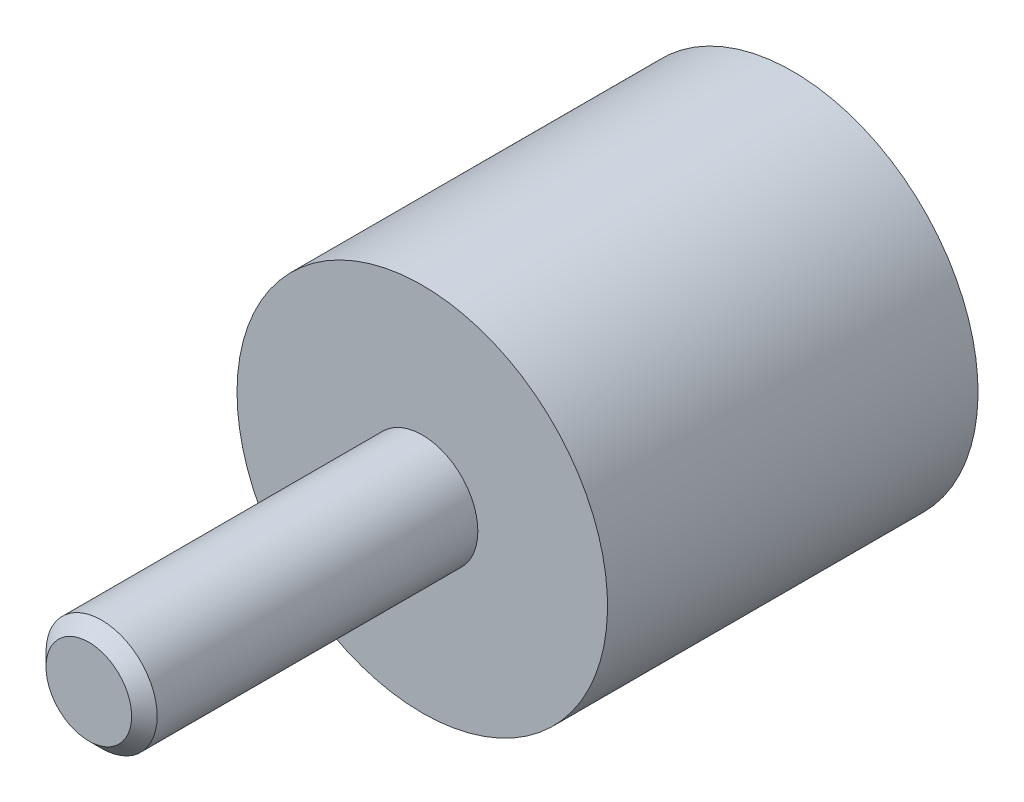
ISO-10303-21;
HEADER;
FILE_DESCRIPTION(('STEP AP214'),'2;1');
FILE_NAME('part.step','',(''),(''),'','','');
FILE_SCHEMA(('AUTOMOTIVE_DESIGN { 1 0 10303 214 1 1 1 1 }'));
ENDSEC;
DATA;
#1=APPLICATION_CONTEXT('core data for automotive mechanical design processes');
#2=APPLICATION_PROTOCOL_DEFINITION('international standard','automotive_design',2000,#1);
#3=PRODUCT_CONTEXT('',#1,'mechanical');
#4=PRODUCT('Part','Part','',(#3));
#5=PRODUCT_RELATED_PRODUCT_CATEGORY('part','',(#4));
#6=PRODUCT_DEFINITION_FORMATION('','',#4);
#7=PRODUCT_DEFINITION_CONTEXT('part definition',#1,'design');
#8=PRODUCT_DEFINITION('design','',#6,#7);
#9=PRODUCT_DEFINITION_SHAPE('','',#8);
#10=(LENGTH_UNIT() NAMED_UNIT(*) SI_UNIT(.MILLI.,.METRE.));
#11=(NAMED_UNIT(*) PLANE_ANGLE_UNIT() SI_UNIT($,.RADIAN.));
#12=(NAMED_UNIT(*) SI_UNIT($,.STERADIAN.) SOLID_ANGLE_UNIT());
#13=UNCERTAINTY_MEASURE_WITH_UNIT(LENGTH_MEASURE(1.E-05),#10,'distance_accuracy_value','');
#14=(GEOMETRIC_REPRESENTATION_CONTEXT(3) GLOBAL_UNCERTAINTY_ASSIGNED_CONTEXT((#13)) GLOBAL_UNIT_ASSIGNED_CONTEXT((#10,
#11,#12)) REPRESENTATION_CONTEXT('',''));
#15=CARTESIAN_POINT('',(0.,0.,0.));
#16=DIRECTION('',(0.,0.,1.));
#17=DIRECTION('',(1.,0.,0.));
#18=AXIS2_PLACEMENT_3D('',#15,#16,#17);
#19=CARTESIAN_POINT('',(0.,0.,0.5));
#20=DIRECTION('',(0.,0.,1.));
#21=DIRECTION('',(0.,-1.,0.));
#22=AXIS2_PLACEMENT_3D('',#19,#20,#21);
#23=CYLINDRICAL_SURFACE('',#22,10.);
#24=CARTESIAN_POINT('',(0.,0.,0.));
#25=DIRECTION('',(0.,0.,1.));
#26=DIRECTION('',(0.,-1.,0.));
#27=AXIS2_PLACEMENT_3D('',#24,#25,#26);
#28=CIRCLE('',#27,10.);
#29=CARTESIAN_POINT('',(0.,-10.,0.));
#30=VERTEX_POINT('',#29);
#31=EDGE_CURVE('E27',#30,#30,#28,.T.);
#32=ORIENTED_EDGE('',*,*,#31,.T.);
#33=EDGE_LOOP('',(#32));
#34=FACE_BOUND('',#33,.T.);
#35=CARTESIAN_POINT('',(0.,0.,20.));
#36=DIRECTION('',(0.,0.,-1.));
#37=DIRECTION('',(-1.,0.,0.));
#38=AXIS2_PLACEMENT_3D('',#35,#36,#37);
#39=CIRCLE('',#38,10.);
#40=CARTESIAN_POINT('',(-10.,0.,20.));
#41=VERTEX_POINT('',#40);
#42=EDGE_CURVE('E35',#41,#41,#39,.T.);
#43=ORIENTED_EDGE('',*,*,#42,.T.);
#44=EDGE_LOOP('',(#43));
#45=FACE_BOUND('',#44,.T.);
#46=ADVANCED_FACE('F12',(#34,#45),#23,.T.);
#47=CARTESIAN_POINT('',(10.,0.,0.));
#48=DIRECTION('',(0.,0.,-1.));
#49=DIRECTION('',(0.,1.,0.));
#50=AXIS2_PLACEMENT_3D('',#47,#48,#49);
#51=PLANE('',#50);
#52=CARTESIAN_POINT('',(0.,0.,0.));
#53=DIRECTION('',(0.,0.,-1.));
#54=DIRECTION('',(0.,1.,0.));
#55=AXIS2_PLACEMENT_3D('',#52,#53,#54);
#56=CIRCLE('',#55,3.45);
#57=CARTESIAN_POINT('',(0.,3.45,0.));
#58=VERTEX_POINT('',#57);
#59=EDGE_CURVE('E19',#58,#58,#56,.F.);
#60=ORIENTED_EDGE('',*,*,#59,.T.);
#61=EDGE_LOOP('',(#60));
#62=FACE_BOUND('',#61,.T.);
#63=ORIENTED_EDGE('',*,*,#31,.F.);
#64=EDGE_LOOP('',(#63));
#65=FACE_BOUND('',#64,.T.);
#66=ADVANCED_FACE('F58',(#62,#65),#51,.T.);
#67=CARTESIAN_POINT('',(0.,0.,0.));
#68=DIRECTION('',(0.,0.,1.));
#69=DIRECTION('',(0.,-1.,0.));
#70=AXIS2_PLACEMENT_3D('',#67,#68,#69);
#71=CYLINDRICAL_SURFACE('',#70,3.);
#72=CARTESIAN_POINT('',(0.,0.,0.45));
#73=DIRECTION('',(0.,0.,-1.));
#74=DIRECTION('',(0.,1.,0.));
#75=AXIS2_PLACEMENT_3D('',#72,#73,#74);
#76=CIRCLE('',#75,3.);
#77=CARTESIAN_POINT('',(0.,3.,0.45));
#78=VERTEX_POINT('',#77);
#79=EDGE_CURVE('E23',#78,#78,#76,.T.);
#80=ORIENTED_EDGE('',*,*,#79,.T.);
#81=EDGE_LOOP('',(#80));
#82=FACE_BOUND('',#81,.T.);
#83=CARTESIAN_POINT('',(0.,0.,6.));
#84=DIRECTION('',(0.,0.,-1.));
#85=DIRECTION('',(0.,1.,0.));
#86=AXIS2_PLACEMENT_3D('',#83,#84,#85);
#87=CIRCLE('',#86,3.);
#88=CARTESIAN_POINT('',(0.,3.,6.));
#89=VERTEX_POINT('',#88);
#90=EDGE_CURVE('E32',#89,#89,#87,.T.);
#91=ORIENTED_EDGE('',*,*,#90,.F.);
#92=EDGE_LOOP('',(#91));
#93=FACE_BOUND('',#92,.T.);
#94=ADVANCED_FACE('F63',(#82,#93),#71,.F.);
#95=CARTESIAN_POINT('',(0.,0.,6.));
#96=DIRECTION('',(0.,0.,-1.));
#97=DIRECTION('',(0.,1.,0.));
#98=AXIS2_PLACEMENT_3D('',#95,#96,#97);
#99=PLANE('',#98);
#100=ORIENTED_EDGE('',*,*,#90,.T.);
#101=EDGE_LOOP('',(#100));
#102=FACE_BOUND('',#101,.T.);
#103=ADVANCED_FACE('F69',(#102),#99,.T.);
#104=CARTESIAN_POINT('',(0.,0.,0.45));
#105=DIRECTION('',(0.,0.,-1.));
#106=DIRECTION('',(0.,1.,0.));
#107=AXIS2_PLACEMENT_3D('',#104,#105,#106);
#108=CONICAL_SURFACE('',#107,3.,0.785398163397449);
#109=ORIENTED_EDGE('',*,*,#59,.F.);
#110=EDGE_LOOP('',(#109));
#111=FACE_BOUND('',#110,.T.);
#112=ORIENTED_EDGE('',*,*,#79,.F.);
#113=EDGE_LOOP('',(#112));
#114=FACE_BOUND('',#113,.T.);
#115=ADVANCED_FACE('F14',(#111,#114),#108,.F.);
#116=CARTESIAN_POINT('',(0.,10.,20.));
#117=DIRECTION('',(0.,0.,1.));
#118=DIRECTION('',(1.,0.,0.));
#119=AXIS2_PLACEMENT_3D('',#116,#117,#118);
#120=PLANE('',#119);
#121=CARTESIAN_POINT('',(0.,0.,20.));
#122=DIRECTION('',(0.,0.,1.));
#123=DIRECTION('',(1.,0.,0.));
#124=AXIS2_PLACEMENT_3D('',#121,#122,#123);
#125=CIRCLE('',#124,3.);
#126=CARTESIAN_POINT('',(3.,0.,20.));
#127=VERTEX_POINT('',#126);
#128=EDGE_CURVE('E8',#127,#127,#125,.F.);
#129=ORIENTED_EDGE('',*,*,#128,.T.);
#130=EDGE_LOOP('',(#129));
#131=FACE_BOUND('',#130,.T.);
#132=ORIENTED_EDGE('',*,*,#42,.F.);
#133=EDGE_LOOP('',(#132));
#134=FACE_BOUND('',#133,.T.);
#135=ADVANCED_FACE('F73',(#131,#134),#120,.T.);
#136=CARTESIAN_POINT('',(0.,0.,15.));
#137=DIRECTION('',(0.,0.,1.));
#138=DIRECTION('',(0.,-1.,0.));
#139=AXIS2_PLACEMENT_3D('',#136,#137,#138);
#140=CYLINDRICAL_SURFACE('',#139,3.);
#141=ORIENTED_EDGE('',*,*,#128,.F.);
#142=EDGE_LOOP('',(#141));
#143=FACE_BOUND('',#142,.T.);
#144=CARTESIAN_POINT('',(0.,0.,37.3111812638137));
#145=DIRECTION('',(0.,0.,-1.));
#146=DIRECTION('',(-1.,0.,0.));
#147=AXIS2_PLACEMENT_3D('',#144,#145,#146);
#148=CIRCLE('',#147,3.);
#149=CARTESIAN_POINT('',(-3.,0.,37.3111812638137));
#150=VERTEX_POINT('',#149);
#151=EDGE_CURVE('E38',#150,#150,#148,.T.);
#152=ORIENTED_EDGE('',*,*,#151,.T.);
#153=EDGE_LOOP('',(#152));
#154=FACE_BOUND('',#153,.T.);
#155=ADVANCED_FACE('F55',(#143,#154),#140,.T.);
#156=CARTESIAN_POINT('',(0.,0.,37.3111812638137));
#157=DIRECTION('',(0.,0.,-1.));
#158=DIRECTION('',(-1.,0.,0.));
#159=AXIS2_PLACEMENT_3D('',#156,#157,#158);
#160=CONICAL_SURFACE('',#159,3.,0.785398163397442);
#161=CARTESIAN_POINT('',(0.,0.,38.));
#162=DIRECTION('',(0.,0.,-1.));
#163=DIRECTION('',(-1.,0.,0.));
#164=AXIS2_PLACEMENT_3D('',#161,#162,#163);
#165=CIRCLE('',#164,2.31118126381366);
#166=CARTESIAN_POINT('',(-2.31118126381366,0.,38.));
#167=VERTEX_POINT('',#166);
#168=EDGE_CURVE('E41',#167,#167,#165,.T.);
#169=ORIENTED_EDGE('',*,*,#168,.T.);
#170=EDGE_LOOP('',(#169));
#171=FACE_BOUND('',#170,.T.);
#172=ORIENTED_EDGE('',*,*,#151,.F.);
#173=EDGE_LOOP('',(#172));
#174=FACE_BOUND('',#173,.T.);
#175=ADVANCED_FACE('F45',(#171,#174),#160,.T.);
#176=CARTESIAN_POINT('',(0.,2.31118126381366,38.));
#177=DIRECTION('',(0.,0.,1.));
#178=DIRECTION('',(1.,0.,0.));
#179=AXIS2_PLACEMENT_3D('',#176,#177,#178);
#180=PLANE('',#179);
#181=ORIENTED_EDGE('',*,*,#168,.F.);
#182=EDGE_LOOP('',(#181));
#183=FACE_BOUND('',#182,.T.);
#184=ADVANCED_FACE('F48',(#183),#180,.T.);
#185=CLOSED_SHELL('',(#46,#66,#94,#103,#115,#135,#155,#175,#184));
#186=MANIFOLD_SOLID_BREP('B1',#185);
#187=ADVANCED_BREP_SHAPE_REPRESENTATION('',(#18,#186),#14);
#188=SHAPE_DEFINITION_REPRESENTATION(#9,#187);
ENDSEC;
END-ISO-10303-21;
